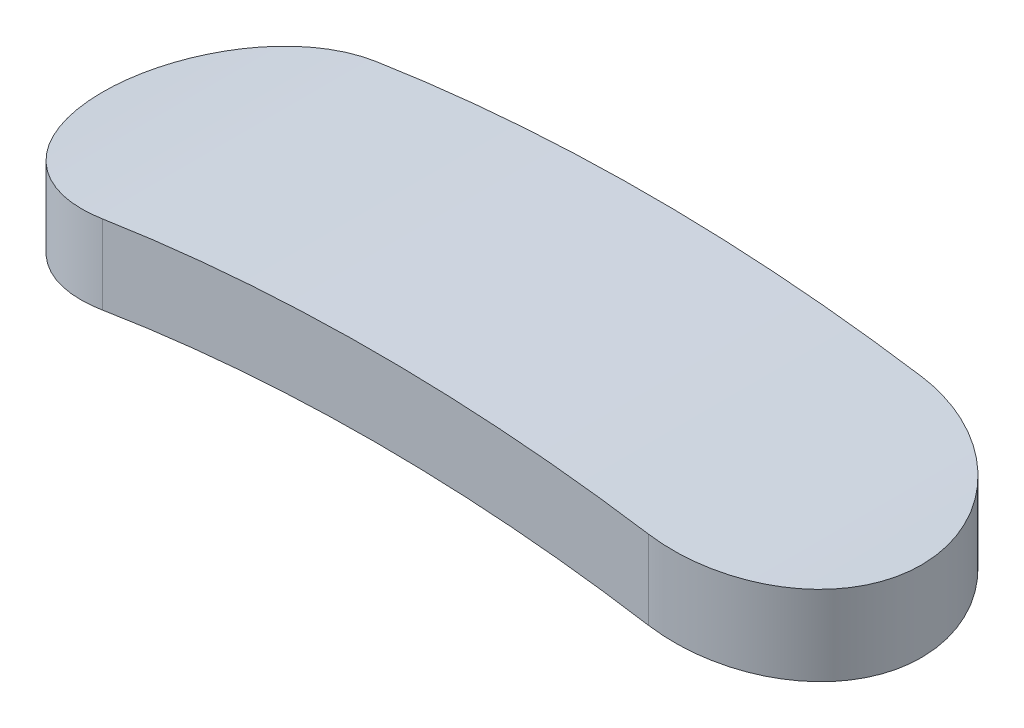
from build123d import *

# Parameters (mm, degrees)
ESQUISSE1_R        = 22.8
ESQUISSE1_R_2      = 21.8
BOSS_EXTRU_1_DEPTH = 20
BOSS_EXTRU_2_DEPTH = 30


with BuildPart() as part:
    # Esquisse1 → Boss.-Extru.1 (new body)
    with BuildSketch(Plane.XY):
        Circle(ESQUISSE1_R)
        Circle(ESQUISSE1_R_2, mode=Mode.SUBTRACT)
    extrude(amount=BOSS_EXTRU_1_DEPTH)


with BuildPart() as body_2:
    # Esquisse2 → Boss.-Extru.2 (new body)
    with BuildSketch(Plane(origin=(0, 0, 0), x_dir=(1, 0, 0), z_dir=(0, 1, 0))):
        with BuildLine():
            Line((-3.5, -8.474667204), (3.5, -8.474667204))
            ThreePointArc((3.5, -8.474667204), (5.25, -10.224667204), (3.5, -11.974667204))
            Line((3.5, -11.974667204), (-3.5, -11.974667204))
            ThreePointArc((-3.5, -11.974667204), (-5.25, -10.224667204), (-3.5, -8.474667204))
        make_face()
    extrude(amount=BOSS_EXTRU_2_DEPTH)


with BuildPart() as part_1:
    add(part.part)

    # Combiner1: intersect body 2
    add(body_2.part, mode=Mode.INTERSECT)


solid = part_1.part
